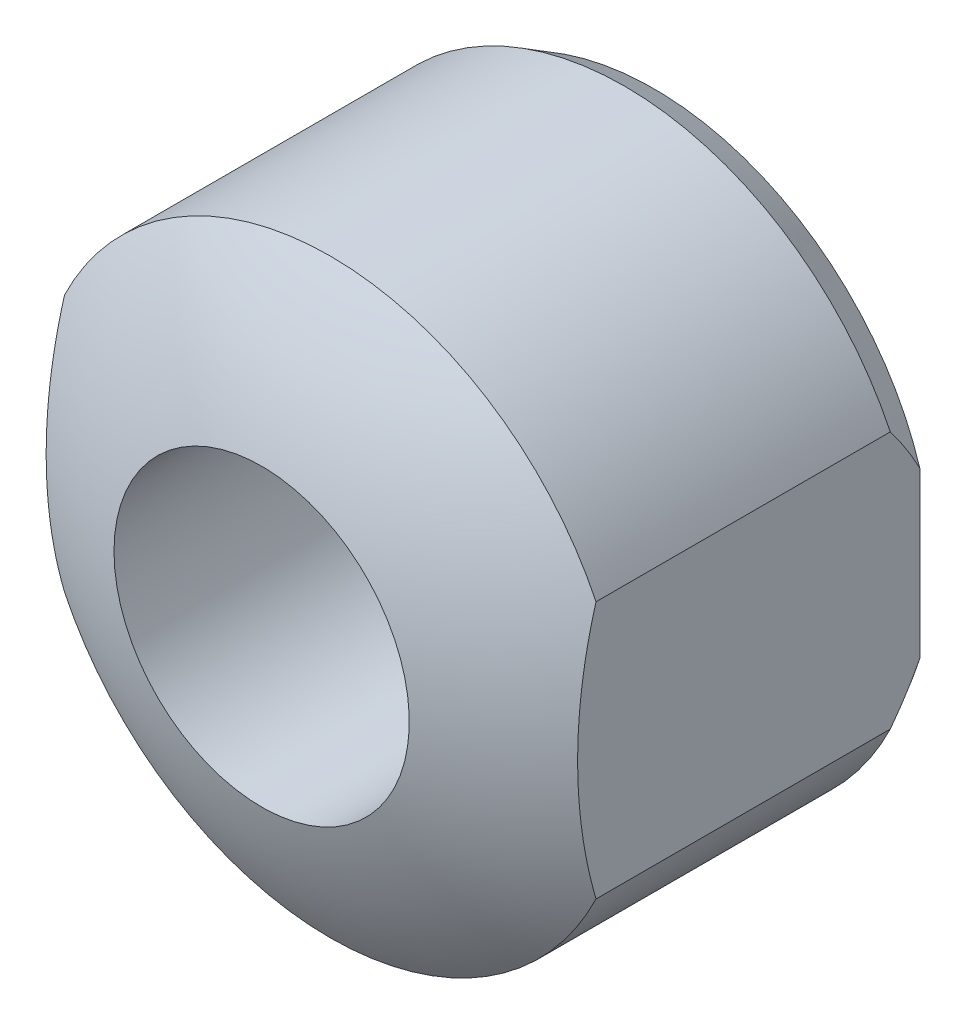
ISO-10303-21;
HEADER;
FILE_DESCRIPTION(('STEP AP214'),'2;1');
FILE_NAME('part.step','',(''),(''),'','','');
FILE_SCHEMA(('AUTOMOTIVE_DESIGN { 1 0 10303 214 1 1 1 1 }'));
ENDSEC;
DATA;
#1=APPLICATION_CONTEXT('core data for automotive mechanical design processes');
#2=APPLICATION_PROTOCOL_DEFINITION('international standard','automotive_design',2000,#1);
#3=PRODUCT_CONTEXT('',#1,'mechanical');
#4=PRODUCT('Part','Part','',(#3));
#5=PRODUCT_RELATED_PRODUCT_CATEGORY('part','',(#4));
#6=PRODUCT_DEFINITION_FORMATION('','',#4);
#7=PRODUCT_DEFINITION_CONTEXT('part definition',#1,'design');
#8=PRODUCT_DEFINITION('design','',#6,#7);
#9=PRODUCT_DEFINITION_SHAPE('','',#8);
#10=(LENGTH_UNIT() NAMED_UNIT(*) SI_UNIT(.MILLI.,.METRE.));
#11=(NAMED_UNIT(*) PLANE_ANGLE_UNIT() SI_UNIT($,.RADIAN.));
#12=(NAMED_UNIT(*) SI_UNIT($,.STERADIAN.) SOLID_ANGLE_UNIT());
#13=UNCERTAINTY_MEASURE_WITH_UNIT(LENGTH_MEASURE(1.E-05),#10,'distance_accuracy_value','');
#14=(GEOMETRIC_REPRESENTATION_CONTEXT(3) GLOBAL_UNCERTAINTY_ASSIGNED_CONTEXT((#13)) GLOBAL_UNIT_ASSIGNED_CONTEXT((#10,
#11,#12)) REPRESENTATION_CONTEXT('',''));
#15=CARTESIAN_POINT('',(0.,0.,0.));
#16=DIRECTION('',(0.,0.,1.));
#17=DIRECTION('',(1.,0.,0.));
#18=AXIS2_PLACEMENT_3D('',#15,#16,#17);
#19=CARTESIAN_POINT('',(-4.6750797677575E-13,0.,-2.00000000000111));
#20=DIRECTION('',(0.,0.,1.));
#21=DIRECTION('',(1.,0.,0.));
#22=AXIS2_PLACEMENT_3D('',#19,#20,#21);
#23=SPHERICAL_SURFACE('',#22,9.0000000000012);
#24=CARTESIAN_POINT('',(-4.5,0.,-2.00000000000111));
#25=DIRECTION('',(1.,0.,0.));
#26=DIRECTION('',(0.,1.,0.));
#27=AXIS2_PLACEMENT_3D('',#24,#25,#26);
#28=CIRCLE('',#27,7.7942286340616);
#29=CARTESIAN_POINT('',(-4.5,-2.17944947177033,5.4833147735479));
#30=VERTEX_POINT('',#29);
#31=CARTESIAN_POINT('',(-4.5,2.17944947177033,5.4833147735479));
#32=VERTEX_POINT('',#31);
#33=EDGE_CURVE('E109',#30,#32,#28,.F.);
#34=ORIENTED_EDGE('',*,*,#33,.F.);
#35=CARTESIAN_POINT('',(0.,0.,5.4833147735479));
#36=DIRECTION('',(0.,0.,1.));
#37=DIRECTION('',(0.,-1.,0.));
#38=AXIS2_PLACEMENT_3D('',#35,#36,#37);
#39=CIRCLE('',#38,5.);
#40=CARTESIAN_POINT('',(4.5,-2.17944947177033,5.4833147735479));
#41=VERTEX_POINT('',#40);
#42=EDGE_CURVE('E21',#30,#41,#39,.T.);
#43=ORIENTED_EDGE('',*,*,#42,.T.);
#44=CARTESIAN_POINT('',(4.5,0.,-2.00000000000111));
#45=DIRECTION('',(-1.,0.,0.));
#46=DIRECTION('',(0.,-1.,0.));
#47=AXIS2_PLACEMENT_3D('',#44,#45,#46);
#48=CIRCLE('',#47,7.79422863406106);
#49=CARTESIAN_POINT('',(4.5,2.17944947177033,5.4833147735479));
#50=VERTEX_POINT('',#49);
#51=EDGE_CURVE('E91',#50,#41,#48,.F.);
#52=ORIENTED_EDGE('',*,*,#51,.F.);
#53=EDGE_CURVE('E9',#50,#32,#39,.T.);
#54=ORIENTED_EDGE('',*,*,#53,.T.);
#55=EDGE_LOOP('',(#34,#43,#52,#54));
#56=FACE_BOUND('',#55,.T.);
#57=CARTESIAN_POINT('',(0.,0.,6.64580823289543));
#58=DIRECTION('',(0.,0.,-1.));
#59=DIRECTION('',(-1.,0.,0.));
#60=AXIS2_PLACEMENT_3D('',#57,#58,#59);
#61=CIRCLE('',#60,2.5);
#62=CARTESIAN_POINT('',(-2.5,0.,6.64580823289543));
#63=VERTEX_POINT('',#62);
#64=EDGE_CURVE('E85',#63,#63,#61,.T.);
#65=ORIENTED_EDGE('',*,*,#64,.T.);
#66=EDGE_LOOP('',(#65));
#67=FACE_BOUND('',#66,.T.);
#68=ADVANCED_FACE('F14',(#56,#67),#23,.T.);
#69=CARTESIAN_POINT('',(0.,0.,0.));
#70=DIRECTION('',(0.,0.,1.));
#71=DIRECTION('',(0.,-1.,0.));
#72=AXIS2_PLACEMENT_3D('',#69,#70,#71);
#73=CYLINDRICAL_SURFACE('',#72,5.);
#74=ORIENTED_EDGE('',*,*,#42,.F.);
#75=DIRECTION('',(0.,0.,1.));
#76=VECTOR('',#75,1.);
#77=CARTESIAN_POINT('',(-4.5,-2.17944947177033,0.));
#78=LINE('',#77,#76);
#79=CARTESIAN_POINT('',(-4.5,-2.17944947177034,0.5));
#80=VERTEX_POINT('',#79);
#81=EDGE_CURVE('E76',#30,#80,#78,.F.);
#82=ORIENTED_EDGE('',*,*,#81,.T.);
#83=CARTESIAN_POINT('',(0.,0.,0.5));
#84=DIRECTION('',(0.,0.,1.));
#85=DIRECTION('',(0.,-1.,0.));
#86=AXIS2_PLACEMENT_3D('',#83,#84,#85);
#87=CIRCLE('',#86,5.);
#88=CARTESIAN_POINT('',(4.5,-2.17944947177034,0.5));
#89=VERTEX_POINT('',#88);
#90=EDGE_CURVE('E84',#80,#89,#87,.T.);
#91=ORIENTED_EDGE('',*,*,#90,.T.);
#92=DIRECTION('',(0.,0.,1.));
#93=VECTOR('',#92,1.);
#94=CARTESIAN_POINT('',(4.5,-2.17944947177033,0.));
#95=LINE('',#94,#93);
#96=EDGE_CURVE('E105',#89,#41,#95,.T.);
#97=ORIENTED_EDGE('',*,*,#96,.T.);
#98=EDGE_LOOP('',(#74,#82,#91,#97));
#99=FACE_BOUND('',#98,.T.);
#100=ADVANCED_FACE('F104',(#99),#73,.T.);
#101=CARTESIAN_POINT('',(0.,0.,0.5));
#102=DIRECTION('',(0.,0.,1.));
#103=DIRECTION('',(0.,-1.,0.));
#104=AXIS2_PLACEMENT_3D('',#101,#102,#103);
#105=CONICAL_SURFACE('',#104,5.,0.523598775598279);
#106=ORIENTED_EDGE('',*,*,#90,.F.);
#107=CARTESIAN_POINT('',(-4.5,-5.0188098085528,3.5151626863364));
#108=CARTESIAN_POINT('',(-4.5,-4.90794191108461,3.37222700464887));
#109=CARTESIAN_POINT('',(-4.5,-4.79608084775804,3.23004881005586));
#110=CARTESIAN_POINT('',(-4.5,-4.56991738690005,2.94757122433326));
#111=CARTESIAN_POINT('',(-4.5,-4.45561418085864,2.80727248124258));
#112=CARTESIAN_POINT('',(-4.5,-4.22260911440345,2.52711902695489));
#113=CARTESIAN_POINT('',(-4.5,-4.10386854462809,2.38729640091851));
#114=CARTESIAN_POINT('',(-4.5,-3.86293020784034,2.11068843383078));
#115=CARTESIAN_POINT('',(-4.5,-3.74073294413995,1.97390265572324));
#116=CARTESIAN_POINT('',(-4.5,-3.48308543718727,1.6943486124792));
#117=CARTESIAN_POINT('',(-4.5,-3.34731834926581,1.55187082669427));
#118=CARTESIAN_POINT('',(-4.5,-3.06974114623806,1.27274992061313));
#119=CARTESIAN_POINT('',(-4.5,-2.92792833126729,1.13610946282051));
#120=CARTESIAN_POINT('',(-4.5,-2.63769738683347,0.871736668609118));
#121=CARTESIAN_POINT('',(-4.5,-2.48932292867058,0.743956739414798));
#122=CARTESIAN_POINT('',(-4.5,-2.18349580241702,0.499865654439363));
#123=CARTESIAN_POINT('',(-4.5,-2.02605405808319,0.383541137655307));
#124=CARTESIAN_POINT('',(-4.5,-1.78663625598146,0.22493208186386));
#125=CARTESIAN_POINT('',(-4.5,-1.70897444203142,0.176128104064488));
#126=CARTESIAN_POINT('',(-4.5,-1.55098989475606,0.0829326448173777));
#127=CARTESIAN_POINT('',(-4.5,-1.47066620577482,0.0385427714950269));
#128=CARTESIAN_POINT('',(-4.5,-1.30784299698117,-0.0446296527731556));
#129=CARTESIAN_POINT('',(-4.5,-1.22536247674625,-0.0834490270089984));
#130=CARTESIAN_POINT('',(-4.5,-1.05776162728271,-0.154833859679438));
#131=CARTESIAN_POINT('',(-4.5,-0.972641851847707,-0.187400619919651));
#132=CARTESIAN_POINT('',(-4.5,-0.739201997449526,-0.265504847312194));
#133=CARTESIAN_POINT('',(-4.5,-0.588437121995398,-0.304113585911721));
#134=CARTESIAN_POINT('',(-4.5,-0.282539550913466,-0.355110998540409));
#135=CARTESIAN_POINT('',(-4.5,-0.127411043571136,-0.367524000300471));
#136=CARTESIAN_POINT('',(-4.5,0.182772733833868,-0.364231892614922));
#137=CARTESIAN_POINT('',(-4.5,0.337827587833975,-0.348486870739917));
#138=CARTESIAN_POINT('',(-4.5,0.643120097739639,-0.291243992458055));
#139=CARTESIAN_POINT('',(-4.5,0.793349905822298,-0.249706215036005));
#140=CARTESIAN_POINT('',(-4.5,1.15880598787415,-0.12033487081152));
#141=CARTESIAN_POINT('',(-4.5,1.36945500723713,-0.0197663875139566));
#142=CARTESIAN_POINT('',(-4.5,1.67256417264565,0.153280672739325));
#143=CARTESIAN_POINT('',(-4.5,1.77173834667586,0.21488362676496));
#144=CARTESIAN_POINT('',(-4.5,1.96614271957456,0.344041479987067));
#145=CARTESIAN_POINT('',(-4.5,2.06137380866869,0.411595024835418));
#146=CARTESIAN_POINT('',(-4.5,2.30741799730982,0.595629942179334));
#147=CARTESIAN_POINT('',(-4.5,2.45528404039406,0.716030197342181));
#148=CARTESIAN_POINT('',(-4.5,2.67036058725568,0.902373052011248));
#149=CARTESIAN_POINT('',(-4.5,2.74049583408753,0.965017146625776));
#150=CARTESIAN_POINT('',(-4.5,2.87905632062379,1.0921269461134));
#151=CARTESIAN_POINT('',(-4.5,2.94748210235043,1.15659205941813));
#152=CARTESIAN_POINT('',(-4.5,3.01516268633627,1.22183624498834));
#153=B_SPLINE_CURVE_WITH_KNOTS('',3,(#107,#108,#109,#110,#111,#112,#113,#114,#115,#116,#117,
#118,#119,#120,#121,#122,#123,#124,#125,#126,#127,#128,#129,#130,#131,#132,#133,#134,#135,#136,
#137,#138,#139,#140,#141,#142,#143,#144,#145,#146,#147,#148,#149,#150,#151,#152),.UNSPECIFIED.,
.F.,.F.,(4,2,2,2,2,2,2,2,2,2,2,2,2,2,2,2,2,2,2,2,2,2,4),(0.,0.542689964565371,1.08556246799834,
1.63583034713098,2.1860185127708,2.7763022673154,3.36685244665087,3.95393526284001,
4.54032501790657,4.81537958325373,5.09053399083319,5.36377626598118,5.6369615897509,
6.10179897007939,6.56620447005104,7.03126876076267,7.49705466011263,8.19307286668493,
8.54321858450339,8.89328481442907,9.46479429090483,9.74688878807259,10.0288926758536),.UNSPECIFIED.);
#154=CARTESIAN_POINT('',(-4.5,-1.39519962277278,0.));
#155=VERTEX_POINT('',#154);
#156=EDGE_CURVE('E68',#80,#155,#153,.T.);
#157=ORIENTED_EDGE('',*,*,#156,.T.);
#158=CARTESIAN_POINT('',(0.,0.,0.));
#159=DIRECTION('',(0.,0.,1.));
#160=DIRECTION('',(0.,-1.,0.));
#161=AXIS2_PLACEMENT_3D('',#158,#159,#160);
#162=CIRCLE('',#161,4.7113248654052);
#163=CARTESIAN_POINT('',(4.5,-1.39519962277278,0.));
#164=VERTEX_POINT('',#163);
#165=EDGE_CURVE('E82',#155,#164,#162,.T.);
#166=ORIENTED_EDGE('',*,*,#165,.T.);
#167=CARTESIAN_POINT('',(4.5,3.01516268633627,1.22183624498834));
#168=CARTESIAN_POINT('',(4.5,2.95586660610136,1.16467332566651));
#169=CARTESIAN_POINT('',(4.5,2.89599591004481,1.10810789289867));
#170=CARTESIAN_POINT('',(4.5,2.77496213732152,0.996347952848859));
#171=CARTESIAN_POINT('',(4.5,2.7137987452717,0.941153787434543));
#172=CARTESIAN_POINT('',(4.5,2.52757348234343,0.777384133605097));
#173=CARTESIAN_POINT('',(4.5,2.40037352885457,0.671203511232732));
#174=CARTESIAN_POINT('',(4.5,2.13536694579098,0.464484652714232));
#175=CARTESIAN_POINT('',(4.5,1.9973588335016,0.364202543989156));
#176=CARTESIAN_POINT('',(4.5,1.71305567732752,0.176532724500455));
#177=CARTESIAN_POINT('',(4.5,1.56677990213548,0.0891166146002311));
#178=CARTESIAN_POINT('',(4.5,1.34171213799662,-0.0278732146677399));
#179=CARTESIAN_POINT('',(4.5,1.2664453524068,-0.0642495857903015));
#180=CARTESIAN_POINT('',(4.5,1.11363024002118,-0.131920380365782));
#181=CARTESIAN_POINT('',(4.5,1.03608171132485,-0.163214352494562));
#182=CARTESIAN_POINT('',(4.5,0.879373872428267,-0.219699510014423));
#183=CARTESIAN_POINT('',(4.5,0.800229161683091,-0.244930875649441));
#184=CARTESIAN_POINT('',(4.5,0.640126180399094,-0.288751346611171));
#185=CARTESIAN_POINT('',(4.5,0.559168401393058,-0.307342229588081));
#186=CARTESIAN_POINT('',(4.5,0.394736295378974,-0.337394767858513));
#187=CARTESIAN_POINT('',(4.5,0.311242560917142,-0.348751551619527));
#188=CARTESIAN_POINT('',(4.5,0.143547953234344,-0.363409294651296));
#189=CARTESIAN_POINT('',(4.5,0.0593471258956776,-0.366710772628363));
#190=CARTESIAN_POINT('',(4.5,-0.109037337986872,-0.365102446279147));
#191=CARTESIAN_POINT('',(4.5,-0.193220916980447,-0.360186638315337));
#192=CARTESIAN_POINT('',(4.5,-0.36073493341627,-0.342363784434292));
#193=CARTESIAN_POINT('',(4.5,-0.444065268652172,-0.329455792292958));
#194=CARTESIAN_POINT('',(4.5,-0.618485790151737,-0.294339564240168));
#195=CARTESIAN_POINT('',(4.5,-0.709397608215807,-0.271250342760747));
#196=CARTESIAN_POINT('',(4.5,-0.888766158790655,-0.216936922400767));
#197=CARTESIAN_POINT('',(4.5,-0.977221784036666,-0.185709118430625));
#198=CARTESIAN_POINT('',(4.5,-1.15154953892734,-0.116215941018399));
#199=CARTESIAN_POINT('',(4.5,-1.23741474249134,-0.077933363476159));
#200=CARTESIAN_POINT('',(4.5,-1.40625691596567,0.0044865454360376));
#201=CARTESIAN_POINT('',(4.5,-1.48923397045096,0.0486237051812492));
#202=CARTESIAN_POINT('',(4.5,-1.66628172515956,0.149685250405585));
#203=CARTESIAN_POINT('',(4.5,-1.75983754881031,0.207507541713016));
#204=CARTESIAN_POINT('',(4.5,-1.94342924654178,0.328512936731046));
#205=CARTESIAN_POINT('',(4.5,-2.03346377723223,0.391698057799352));
#206=CARTESIAN_POINT('',(4.5,-2.29904677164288,0.587860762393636));
#207=CARTESIAN_POINT('',(4.5,-2.46982294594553,0.727295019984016));
#208=CARTESIAN_POINT('',(4.5,-2.80246842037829,1.01849615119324));
#209=CARTESIAN_POINT('',(4.5,-2.96426414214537,1.17034513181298));
#210=CARTESIAN_POINT('',(4.5,-3.27980281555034,1.48189346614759));
#211=CARTESIAN_POINT('',(4.5,-3.43355209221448,1.64158645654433));
#212=CARTESIAN_POINT('',(4.5,-3.71188510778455,1.94194570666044));
#213=CARTESIAN_POINT('',(4.5,-3.8373453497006,2.08180703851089));
#214=CARTESIAN_POINT('',(4.5,-4.08460412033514,2.36477062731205));
#215=CARTESIAN_POINT('',(4.5,-4.20640193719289,2.50787350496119));
#216=CARTESIAN_POINT('',(4.5,-4.44470162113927,2.79393957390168));
#217=CARTESIAN_POINT('',(4.5,-4.56125983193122,2.93685601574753));
#218=CARTESIAN_POINT('',(4.5,-4.79182460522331,3.22464127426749));
#219=CARTESIAN_POINT('',(4.5,-4.90583216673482,3.36950928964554));
#220=CARTESIAN_POINT('',(4.5,-5.01880980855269,3.51516268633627));
#221=B_SPLINE_CURVE_WITH_KNOTS('',3,(#167,#168,#169,#170,#171,#172,#173,#174,#175,#176,#177,
#178,#179,#180,#181,#182,#183,#184,#185,#186,#187,#188,#189,#190,#191,#192,#193,#194,#195,#196,
#197,#198,#199,#200,#201,#202,#203,#204,#205,#206,#207,#208,#209,#210,#211,#212,#213,#214,#215,
#216,#217,#218,#219,#220),.UNSPECIFIED.,.F.,.F.,(4,2,2,2,2,2,2,2,2,2,2,2,2,2,2,2,2,2,2,2,2,2,2,
2,2,2,4),(0.,0.24707929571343,0.49421958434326,0.990998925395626,1.50231926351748,
2.01249346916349,2.26313207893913,2.51379293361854,2.7627436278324,3.01162762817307,
3.26404213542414,3.51644038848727,3.76902312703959,4.02163577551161,4.30259136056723,
4.58367161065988,4.86544661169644,5.14721335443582,5.47692582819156,5.80676288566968,
6.46731276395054,7.1326532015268,7.79746253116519,8.36105342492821,8.92475316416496,
9.47798553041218,10.030997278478),.UNSPECIFIED.);
#222=EDGE_CURVE('E107',#164,#89,#221,.T.);
#223=ORIENTED_EDGE('',*,*,#222,.T.);
#224=EDGE_LOOP('',(#106,#157,#166,#223));
#225=FACE_BOUND('',#224,.T.);
#226=ADVANCED_FACE('F80',(#225),#105,.T.);
#227=CARTESIAN_POINT('',(4.7113248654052,0.,0.));
#228=DIRECTION('',(0.,0.,-1.));
#229=DIRECTION('',(0.,1.,0.));
#230=AXIS2_PLACEMENT_3D('',#227,#228,#229);
#231=PLANE('',#230);
#232=CARTESIAN_POINT('',(0.,0.,0.));
#233=DIRECTION('',(0.,0.,1.));
#234=DIRECTION('',(1.,0.,0.));
#235=AXIS2_PLACEMENT_3D('',#232,#233,#234);
#236=CIRCLE('',#235,2.5);
#237=CARTESIAN_POINT('',(2.5,0.,0.));
#238=VERTEX_POINT('',#237);
#239=EDGE_CURVE('E156',#238,#238,#236,.T.);
#240=ORIENTED_EDGE('',*,*,#239,.T.);
#241=EDGE_LOOP('',(#240));
#242=FACE_BOUND('',#241,.T.);
#243=ORIENTED_EDGE('',*,*,#165,.F.);
#244=DIRECTION('',(0.,-1.,0.));
#245=VECTOR('',#244,1.);
#246=CARTESIAN_POINT('',(-4.5,5.,0.));
#247=LINE('',#246,#245);
#248=CARTESIAN_POINT('',(-4.5,1.39519962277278,0.));
#249=VERTEX_POINT('',#248);
#250=EDGE_CURVE('E64',#249,#155,#247,.T.);
#251=ORIENTED_EDGE('',*,*,#250,.F.);
#252=CARTESIAN_POINT('',(4.5,1.39519962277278,0.));
#253=VERTEX_POINT('',#252);
#254=EDGE_CURVE('E90',#253,#249,#162,.T.);
#255=ORIENTED_EDGE('',*,*,#254,.F.);
#256=DIRECTION('',(0.,-1.,0.));
#257=VECTOR('',#256,1.);
#258=CARTESIAN_POINT('',(4.5,5.,0.));
#259=LINE('',#258,#257);
#260=EDGE_CURVE('E88',#253,#164,#259,.T.);
#261=ORIENTED_EDGE('',*,*,#260,.T.);
#262=EDGE_LOOP('',(#243,#251,#255,#261));
#263=FACE_BOUND('',#262,.T.);
#264=ADVANCED_FACE('F87',(#242,#263),#231,.T.);
#265=DIRECTION('',(0.,0.,1.));
#266=VECTOR('',#265,1.);
#267=CARTESIAN_POINT('',(-4.5,2.17944947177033,0.));
#268=LINE('',#267,#266);
#269=CARTESIAN_POINT('',(-4.5,2.17944947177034,0.5));
#270=VERTEX_POINT('',#269);
#271=EDGE_CURVE('E111',#32,#270,#268,.F.);
#272=ORIENTED_EDGE('',*,*,#271,.F.);
#273=ORIENTED_EDGE('',*,*,#53,.F.);
#274=DIRECTION('',(0.,0.,1.));
#275=VECTOR('',#274,1.);
#276=CARTESIAN_POINT('',(4.5,2.17944947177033,0.));
#277=LINE('',#276,#275);
#278=CARTESIAN_POINT('',(4.5,2.17944947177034,0.5));
#279=VERTEX_POINT('',#278);
#280=EDGE_CURVE('E28',#279,#50,#277,.T.);
#281=ORIENTED_EDGE('',*,*,#280,.F.);
#282=EDGE_CURVE('E95',#279,#270,#87,.T.);
#283=ORIENTED_EDGE('',*,*,#282,.T.);
#284=EDGE_LOOP('',(#272,#273,#281,#283));
#285=FACE_BOUND('',#284,.T.);
#286=ADVANCED_FACE('F137',(#285),#73,.T.);
#287=CARTESIAN_POINT('',(-4.5,5.0188098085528,3.5151626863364));
#288=CARTESIAN_POINT('',(-4.5,4.90794191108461,3.37222700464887));
#289=CARTESIAN_POINT('',(-4.5,4.79608084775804,3.23004881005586));
#290=CARTESIAN_POINT('',(-4.5,4.56991738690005,2.94757122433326));
#291=CARTESIAN_POINT('',(-4.5,4.45561418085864,2.80727248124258));
#292=CARTESIAN_POINT('',(-4.5,4.22260911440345,2.52711902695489));
#293=CARTESIAN_POINT('',(-4.5,4.10386854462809,2.38729640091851));
#294=CARTESIAN_POINT('',(-4.5,3.86293020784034,2.11068843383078));
#295=CARTESIAN_POINT('',(-4.5,3.74073294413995,1.97390265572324));
#296=CARTESIAN_POINT('',(-4.5,3.48308543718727,1.6943486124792));
#297=CARTESIAN_POINT('',(-4.5,3.34731834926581,1.55187082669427));
#298=CARTESIAN_POINT('',(-4.5,3.06974114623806,1.27274992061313));
#299=CARTESIAN_POINT('',(-4.5,2.92792833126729,1.13610946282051));
#300=CARTESIAN_POINT('',(-4.5,2.63769738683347,0.871736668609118));
#301=CARTESIAN_POINT('',(-4.5,2.48932292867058,0.743956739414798));
#302=CARTESIAN_POINT('',(-4.5,2.18349580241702,0.499865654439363));
#303=CARTESIAN_POINT('',(-4.5,2.02605405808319,0.383541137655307));
#304=CARTESIAN_POINT('',(-4.5,1.78663625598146,0.22493208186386));
#305=CARTESIAN_POINT('',(-4.5,1.70897444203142,0.176128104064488));
#306=CARTESIAN_POINT('',(-4.5,1.55098989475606,0.0829326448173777));
#307=CARTESIAN_POINT('',(-4.5,1.47066620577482,0.0385427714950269));
#308=CARTESIAN_POINT('',(-4.5,1.30784299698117,-0.0446296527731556));
#309=CARTESIAN_POINT('',(-4.5,1.22536247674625,-0.0834490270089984));
#310=CARTESIAN_POINT('',(-4.5,1.05776162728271,-0.154833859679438));
#311=CARTESIAN_POINT('',(-4.5,0.972641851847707,-0.187400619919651));
#312=CARTESIAN_POINT('',(-4.5,0.739201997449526,-0.265504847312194));
#313=CARTESIAN_POINT('',(-4.5,0.588437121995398,-0.304113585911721));
#314=CARTESIAN_POINT('',(-4.5,0.282539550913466,-0.355110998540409));
#315=CARTESIAN_POINT('',(-4.5,0.127411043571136,-0.367524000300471));
#316=CARTESIAN_POINT('',(-4.5,-0.182772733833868,-0.364231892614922));
#317=CARTESIAN_POINT('',(-4.5,-0.337827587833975,-0.348486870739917));
#318=CARTESIAN_POINT('',(-4.5,-0.643120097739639,-0.291243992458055));
#319=CARTESIAN_POINT('',(-4.5,-0.793349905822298,-0.249706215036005));
#320=CARTESIAN_POINT('',(-4.5,-1.15880598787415,-0.12033487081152));
#321=CARTESIAN_POINT('',(-4.5,-1.36945500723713,-0.0197663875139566));
#322=CARTESIAN_POINT('',(-4.5,-1.67256417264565,0.153280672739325));
#323=CARTESIAN_POINT('',(-4.5,-1.77173834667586,0.21488362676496));
#324=CARTESIAN_POINT('',(-4.5,-1.96614271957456,0.344041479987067));
#325=CARTESIAN_POINT('',(-4.5,-2.06137380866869,0.411595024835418));
#326=CARTESIAN_POINT('',(-4.5,-2.30741799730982,0.595629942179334));
#327=CARTESIAN_POINT('',(-4.5,-2.45528404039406,0.716030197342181));
#328=CARTESIAN_POINT('',(-4.5,-2.67036058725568,0.902373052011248));
#329=CARTESIAN_POINT('',(-4.5,-2.74049583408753,0.965017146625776));
#330=CARTESIAN_POINT('',(-4.5,-2.87905632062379,1.0921269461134));
#331=CARTESIAN_POINT('',(-4.5,-2.94748210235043,1.15659205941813));
#332=CARTESIAN_POINT('',(-4.5,-3.01516268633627,1.22183624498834));
#333=B_SPLINE_CURVE_WITH_KNOTS('',3,(#287,#288,#289,#290,#291,#292,#293,#294,#295,#296,#297,
#298,#299,#300,#301,#302,#303,#304,#305,#306,#307,#308,#309,#310,#311,#312,#313,#314,#315,#316,
#317,#318,#319,#320,#321,#322,#323,#324,#325,#326,#327,#328,#329,#330,#331,#332),.UNSPECIFIED.,
.F.,.F.,(4,2,2,2,2,2,2,2,2,2,2,2,2,2,2,2,2,2,2,2,2,2,4),(0.,0.542689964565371,1.08556246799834,
1.63583034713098,2.1860185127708,2.7763022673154,3.36685244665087,3.95393526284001,
4.54032501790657,4.81537958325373,5.09053399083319,5.36377626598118,5.6369615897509,
6.10179897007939,6.56620447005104,7.03126876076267,7.49705466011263,8.19307286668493,
8.54321858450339,8.89328481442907,9.46479429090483,9.74688878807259,10.0288926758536),.UNSPECIFIED.);
#334=EDGE_CURVE('E71',#270,#249,#333,.T.);
#335=ORIENTED_EDGE('',*,*,#334,.F.);
#336=ORIENTED_EDGE('',*,*,#282,.F.);
#337=CARTESIAN_POINT('',(4.5,-3.01516268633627,1.22183624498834));
#338=CARTESIAN_POINT('',(4.5,-2.95586660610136,1.16467332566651));
#339=CARTESIAN_POINT('',(4.5,-2.89599591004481,1.10810789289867));
#340=CARTESIAN_POINT('',(4.5,-2.77496213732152,0.996347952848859));
#341=CARTESIAN_POINT('',(4.5,-2.7137987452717,0.941153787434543));
#342=CARTESIAN_POINT('',(4.5,-2.52757348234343,0.777384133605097));
#343=CARTESIAN_POINT('',(4.5,-2.40037352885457,0.671203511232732));
#344=CARTESIAN_POINT('',(4.5,-2.13536694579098,0.464484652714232));
#345=CARTESIAN_POINT('',(4.5,-1.9973588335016,0.364202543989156));
#346=CARTESIAN_POINT('',(4.5,-1.71305567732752,0.176532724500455));
#347=CARTESIAN_POINT('',(4.5,-1.56677990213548,0.0891166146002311));
#348=CARTESIAN_POINT('',(4.5,-1.34171213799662,-0.0278732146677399));
#349=CARTESIAN_POINT('',(4.5,-1.2664453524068,-0.0642495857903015));
#350=CARTESIAN_POINT('',(4.5,-1.11363024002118,-0.131920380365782));
#351=CARTESIAN_POINT('',(4.5,-1.03608171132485,-0.163214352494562));
#352=CARTESIAN_POINT('',(4.5,-0.879373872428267,-0.219699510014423));
#353=CARTESIAN_POINT('',(4.5,-0.800229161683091,-0.244930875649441));
#354=CARTESIAN_POINT('',(4.5,-0.640126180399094,-0.288751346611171));
#355=CARTESIAN_POINT('',(4.5,-0.559168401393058,-0.307342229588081));
#356=CARTESIAN_POINT('',(4.5,-0.394736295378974,-0.337394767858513));
#357=CARTESIAN_POINT('',(4.5,-0.311242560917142,-0.348751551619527));
#358=CARTESIAN_POINT('',(4.5,-0.143547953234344,-0.363409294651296));
#359=CARTESIAN_POINT('',(4.5,-0.0593471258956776,-0.366710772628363));
#360=CARTESIAN_POINT('',(4.5,0.109037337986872,-0.365102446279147));
#361=CARTESIAN_POINT('',(4.5,0.193220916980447,-0.360186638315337));
#362=CARTESIAN_POINT('',(4.5,0.36073493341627,-0.342363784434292));
#363=CARTESIAN_POINT('',(4.5,0.444065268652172,-0.329455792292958));
#364=CARTESIAN_POINT('',(4.5,0.618485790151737,-0.294339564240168));
#365=CARTESIAN_POINT('',(4.5,0.709397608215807,-0.271250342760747));
#366=CARTESIAN_POINT('',(4.5,0.888766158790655,-0.216936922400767));
#367=CARTESIAN_POINT('',(4.5,0.977221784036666,-0.185709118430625));
#368=CARTESIAN_POINT('',(4.5,1.15154953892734,-0.116215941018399));
#369=CARTESIAN_POINT('',(4.5,1.23741474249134,-0.077933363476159));
#370=CARTESIAN_POINT('',(4.5,1.40625691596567,0.00448654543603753));
#371=CARTESIAN_POINT('',(4.5,1.48923397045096,0.0486237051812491));
#372=CARTESIAN_POINT('',(4.5,1.66628172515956,0.149685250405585));
#373=CARTESIAN_POINT('',(4.5,1.75983754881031,0.207507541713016));
#374=CARTESIAN_POINT('',(4.5,1.94342924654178,0.328512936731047));
#375=CARTESIAN_POINT('',(4.5,2.03346377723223,0.391698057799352));
#376=CARTESIAN_POINT('',(4.5,2.29904677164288,0.587860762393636));
#377=CARTESIAN_POINT('',(4.5,2.46982294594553,0.727295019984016));
#378=CARTESIAN_POINT('',(4.5,2.80246842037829,1.01849615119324));
#379=CARTESIAN_POINT('',(4.5,2.96426414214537,1.17034513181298));
#380=CARTESIAN_POINT('',(4.5,3.27980281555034,1.48189346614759));
#381=CARTESIAN_POINT('',(4.5,3.43355209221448,1.64158645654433));
#382=CARTESIAN_POINT('',(4.5,3.71188510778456,1.94194570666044));
#383=CARTESIAN_POINT('',(4.5,3.8373453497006,2.08180703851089));
#384=CARTESIAN_POINT('',(4.5,4.08460412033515,2.36477062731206));
#385=CARTESIAN_POINT('',(4.5,4.2064019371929,2.5078735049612));
#386=CARTESIAN_POINT('',(4.5,4.44470162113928,2.79393957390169));
#387=CARTESIAN_POINT('',(4.5,4.56125983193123,2.93685601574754));
#388=CARTESIAN_POINT('',(4.5,4.79182460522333,3.2246412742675));
#389=CARTESIAN_POINT('',(4.5,4.90583216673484,3.36950928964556));
#390=CARTESIAN_POINT('',(4.5,5.01880980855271,3.51516268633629));
#391=B_SPLINE_CURVE_WITH_KNOTS('',3,(#337,#338,#339,#340,#341,#342,#343,#344,#345,#346,#347,
#348,#349,#350,#351,#352,#353,#354,#355,#356,#357,#358,#359,#360,#361,#362,#363,#364,#365,#366,
#367,#368,#369,#370,#371,#372,#373,#374,#375,#376,#377,#378,#379,#380,#381,#382,#383,#384,#385,
#386,#387,#388,#389,#390),.UNSPECIFIED.,.F.,.F.,(4,2,2,2,2,2,2,2,2,2,2,2,2,2,2,2,2,2,2,2,2,2,2,
2,2,2,4),(0.,0.24707929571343,0.49421958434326,0.990998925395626,1.50231926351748,
2.01249346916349,2.26313207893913,2.51379293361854,2.7627436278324,3.01162762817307,
3.26404213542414,3.51644038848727,3.76902312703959,4.02163577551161,4.30259136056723,
4.58367161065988,4.86544661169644,5.14721335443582,5.47692582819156,5.80676288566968,
6.46731276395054,7.1326532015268,7.79746253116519,8.36105342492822,8.92475316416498,
9.4779855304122,10.030997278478),.UNSPECIFIED.);
#392=EDGE_CURVE('E33',#253,#279,#391,.T.);
#393=ORIENTED_EDGE('',*,*,#392,.F.);
#394=ORIENTED_EDGE('',*,*,#254,.T.);
#395=EDGE_LOOP('',(#335,#336,#393,#394));
#396=FACE_BOUND('',#395,.T.);
#397=ADVANCED_FACE('F130',(#396),#105,.T.);
#398=CARTESIAN_POINT('',(4.5,5.,6.7));
#399=DIRECTION('',(-1.,0.,0.));
#400=DIRECTION('',(0.,-1.,0.));
#401=AXIS2_PLACEMENT_3D('',#398,#399,#400);
#402=PLANE('',#401);
#403=ORIENTED_EDGE('',*,*,#51,.T.);
#404=ORIENTED_EDGE('',*,*,#96,.F.);
#405=ORIENTED_EDGE('',*,*,#222,.F.);
#406=ORIENTED_EDGE('',*,*,#260,.F.);
#407=ORIENTED_EDGE('',*,*,#392,.T.);
#408=ORIENTED_EDGE('',*,*,#280,.T.);
#409=EDGE_LOOP('',(#403,#404,#405,#406,#407,#408));
#410=FACE_BOUND('',#409,.T.);
#411=ADVANCED_FACE('F106',(#410),#402,.F.);
#412=CARTESIAN_POINT('',(-4.5,5.,0.));
#413=DIRECTION('',(1.,0.,0.));
#414=DIRECTION('',(0.,1.,0.));
#415=AXIS2_PLACEMENT_3D('',#412,#413,#414);
#416=PLANE('',#415);
#417=ORIENTED_EDGE('',*,*,#33,.T.);
#418=ORIENTED_EDGE('',*,*,#271,.T.);
#419=ORIENTED_EDGE('',*,*,#334,.T.);
#420=ORIENTED_EDGE('',*,*,#250,.T.);
#421=ORIENTED_EDGE('',*,*,#156,.F.);
#422=ORIENTED_EDGE('',*,*,#81,.F.);
#423=EDGE_LOOP('',(#417,#418,#419,#420,#421,#422));
#424=FACE_BOUND('',#423,.T.);
#425=ADVANCED_FACE('F66',(#424),#416,.F.);
#426=CARTESIAN_POINT('',(0.,0.,6.65787729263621));
#427=DIRECTION('',(0.,0.,-1.));
#428=DIRECTION('',(-1.,0.,0.));
#429=AXIS2_PLACEMENT_3D('',#426,#427,#428);
#430=CYLINDRICAL_SURFACE('',#429,2.5);
#431=ORIENTED_EDGE('',*,*,#64,.F.);
#432=EDGE_LOOP('',(#431));
#433=FACE_BOUND('',#432,.T.);
#434=ORIENTED_EDGE('',*,*,#239,.F.);
#435=EDGE_LOOP('',(#434));
#436=FACE_BOUND('',#435,.T.);
#437=ADVANCED_FACE('F166',(#433,#436),#430,.F.);
#438=CLOSED_SHELL('',(#68,#100,#226,#264,#286,#397,#411,#425,#437));
#439=MANIFOLD_SOLID_BREP('B1',#438);
#440=ADVANCED_BREP_SHAPE_REPRESENTATION('',(#18,#439),#14);
#441=SHAPE_DEFINITION_REPRESENTATION(#9,#440);
ENDSEC;
END-ISO-10303-21;
